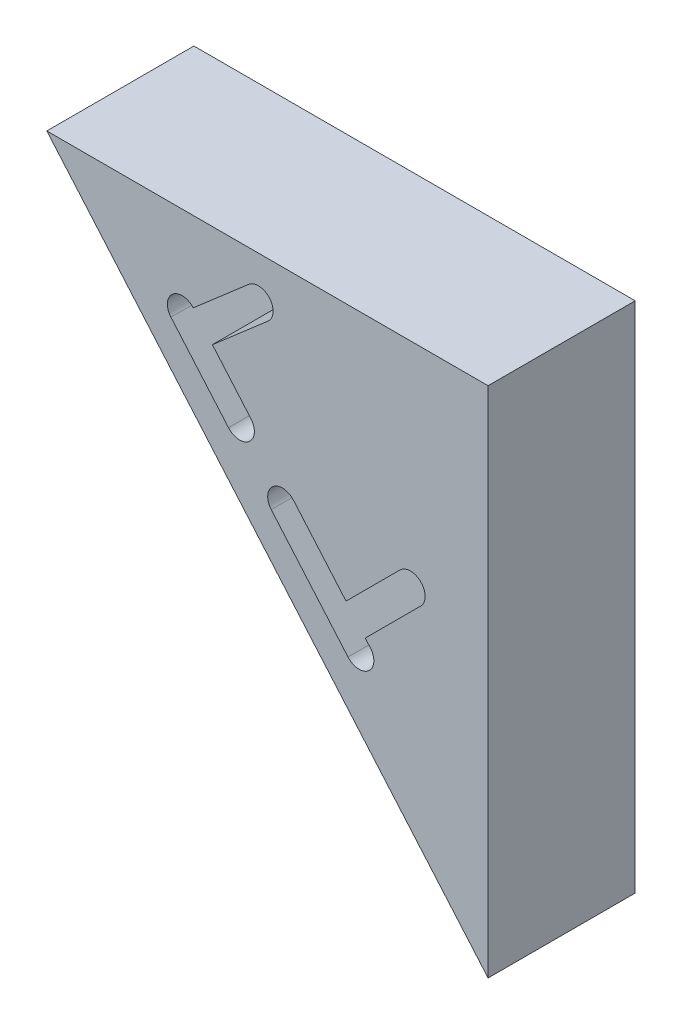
ISO-10303-21;
HEADER;
FILE_DESCRIPTION(('STEP AP214'),'2;1');
FILE_NAME('part.step','',(''),(''),'','','');
FILE_SCHEMA(('AUTOMOTIVE_DESIGN { 1 0 10303 214 1 1 1 1 }'));
ENDSEC;
DATA;
#1=APPLICATION_CONTEXT('core data for automotive mechanical design processes');
#2=APPLICATION_PROTOCOL_DEFINITION('international standard','automotive_design',2000,#1);
#3=PRODUCT_CONTEXT('',#1,'mechanical');
#4=PRODUCT('Part','Part','',(#3));
#5=PRODUCT_RELATED_PRODUCT_CATEGORY('part','',(#4));
#6=PRODUCT_DEFINITION_FORMATION('','',#4);
#7=PRODUCT_DEFINITION_CONTEXT('part definition',#1,'design');
#8=PRODUCT_DEFINITION('design','',#6,#7);
#9=PRODUCT_DEFINITION_SHAPE('','',#8);
#10=(LENGTH_UNIT() NAMED_UNIT(*) SI_UNIT(.MILLI.,.METRE.));
#11=(NAMED_UNIT(*) PLANE_ANGLE_UNIT() SI_UNIT($,.RADIAN.));
#12=(NAMED_UNIT(*) SI_UNIT($,.STERADIAN.) SOLID_ANGLE_UNIT());
#13=UNCERTAINTY_MEASURE_WITH_UNIT(LENGTH_MEASURE(1.E-05),#10,'distance_accuracy_value','');
#14=(GEOMETRIC_REPRESENTATION_CONTEXT(3) GLOBAL_UNCERTAINTY_ASSIGNED_CONTEXT((#13)) GLOBAL_UNIT_ASSIGNED_CONTEXT((#10,
#11,#12)) REPRESENTATION_CONTEXT('',''));
#15=CARTESIAN_POINT('',(0.,0.,0.));
#16=DIRECTION('',(0.,0.,1.));
#17=DIRECTION('',(1.,0.,0.));
#18=AXIS2_PLACEMENT_3D('',#15,#16,#17);
#19=CARTESIAN_POINT('',(-8.62003780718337,-7.4158961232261,5.));
#20=DIRECTION('',(0.758069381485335,0.652173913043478,0.));
#21=DIRECTION('',(-0.652173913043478,0.758069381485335,0.));
#22=AXIS2_PLACEMENT_3D('',#19,#20,#21);
#23=PLANE('',#22);
#24=DIRECTION('',(0.652173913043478,-0.758069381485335,0.));
#25=VECTOR('',#24,1.);
#26=CARTESIAN_POINT('',(-8.62003780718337,-7.4158961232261,0.));
#27=LINE('',#26,#25);
#28=CARTESIAN_POINT('',(-15.,0.,0.));
#29=VERTEX_POINT('',#28);
#30=CARTESIAN_POINT('',(0.,-17.4355957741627,0.));
#31=VERTEX_POINT('',#30);
#32=EDGE_CURVE('E189',#29,#31,#27,.T.);
#33=ORIENTED_EDGE('',*,*,#32,.T.);
#34=DIRECTION('',(0.,0.,-1.));
#35=VECTOR('',#34,1.);
#36=CARTESIAN_POINT('',(0.,-17.4355957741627,5.));
#37=LINE('',#36,#35);
#38=CARTESIAN_POINT('',(0.,-17.4355957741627,5.));
#39=VERTEX_POINT('',#38);
#40=EDGE_CURVE('E11',#39,#31,#37,.T.);
#41=ORIENTED_EDGE('',*,*,#40,.F.);
#42=DIRECTION('',(0.652173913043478,-0.758069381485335,0.));
#43=VECTOR('',#42,1.);
#44=CARTESIAN_POINT('',(-8.62003780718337,-7.4158961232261,5.));
#45=LINE('',#44,#43);
#46=CARTESIAN_POINT('',(-15.,0.,5.));
#47=VERTEX_POINT('',#46);
#48=EDGE_CURVE('E180',#47,#39,#45,.T.);
#49=ORIENTED_EDGE('',*,*,#48,.F.);
#50=DIRECTION('',(0.,0.,-1.));
#51=VECTOR('',#50,1.);
#52=CARTESIAN_POINT('',(-15.,0.,5.));
#53=LINE('',#52,#51);
#54=EDGE_CURVE('E190',#47,#29,#53,.T.);
#55=ORIENTED_EDGE('',*,*,#54,.T.);
#56=EDGE_LOOP('',(#33,#41,#49,#55));
#57=FACE_BOUND('',#56,.T.);
#58=ADVANCED_FACE('F41',(#57),#23,.F.);
#59=CARTESIAN_POINT('',(0.,0.,5.));
#60=DIRECTION('',(-1.,0.,0.));
#61=DIRECTION('',(0.,0.,1.));
#62=AXIS2_PLACEMENT_3D('',#59,#60,#61);
#63=PLANE('',#62);
#64=DIRECTION('',(0.,1.,0.));
#65=VECTOR('',#64,1.);
#66=CARTESIAN_POINT('',(0.,0.,0.));
#67=LINE('',#66,#65);
#68=CARTESIAN_POINT('',(0.,0.,0.));
#69=VERTEX_POINT('',#68);
#70=EDGE_CURVE('E118',#31,#69,#67,.T.);
#71=ORIENTED_EDGE('',*,*,#70,.T.);
#72=DIRECTION('',(0.,0.,-1.));
#73=VECTOR('',#72,1.);
#74=CARTESIAN_POINT('',(0.,0.,5.));
#75=LINE('',#74,#73);
#76=CARTESIAN_POINT('',(0.,0.,5.));
#77=VERTEX_POINT('',#76);
#78=EDGE_CURVE('E52',#77,#69,#75,.T.);
#79=ORIENTED_EDGE('',*,*,#78,.F.);
#80=DIRECTION('',(0.,1.,0.));
#81=VECTOR('',#80,1.);
#82=CARTESIAN_POINT('',(0.,0.,5.));
#83=LINE('',#82,#81);
#84=EDGE_CURVE('E175',#39,#77,#83,.T.);
#85=ORIENTED_EDGE('',*,*,#84,.F.);
#86=ORIENTED_EDGE('',*,*,#40,.T.);
#87=EDGE_LOOP('',(#71,#79,#85,#86));
#88=FACE_BOUND('',#87,.T.);
#89=ADVANCED_FACE('F176',(#88),#63,.F.);
#90=CARTESIAN_POINT('',(-6.99212655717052,-7.00813629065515,5.));
#91=DIRECTION('',(0.,0.,-1.));
#92=DIRECTION('',(-1.,0.,0.));
#93=AXIS2_PLACEMENT_3D('',#90,#91,#92);
#94=CYLINDRICAL_SURFACE('',#93,0.500000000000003);
#95=CARTESIAN_POINT('',(-6.99212655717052,-7.00813629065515,0.));
#96=DIRECTION('',(0.,0.,1.));
#97=DIRECTION('',(1.,0.,0.));
#98=AXIS2_PLACEMENT_3D('',#95,#96,#97);
#99=CIRCLE('',#98,0.500000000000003);
#100=CARTESIAN_POINT('',(-6.61309186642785,-6.68204933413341,0.));
#101=VERTEX_POINT('',#100);
#102=CARTESIAN_POINT('',(-7.37116124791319,-7.33422324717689,0.));
#103=VERTEX_POINT('',#102);
#104=EDGE_CURVE('E295',#101,#103,#99,.T.);
#105=ORIENTED_EDGE('',*,*,#104,.F.);
#106=DIRECTION('',(0.,0.,-1.));
#107=VECTOR('',#106,1.);
#108=CARTESIAN_POINT('',(-6.61309186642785,-6.68204933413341,5.));
#109=LINE('',#108,#107);
#110=CARTESIAN_POINT('',(-6.61309186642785,-6.68204933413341,5.));
#111=VERTEX_POINT('',#110);
#112=EDGE_CURVE('E208',#111,#101,#109,.T.);
#113=ORIENTED_EDGE('',*,*,#112,.F.);
#114=CARTESIAN_POINT('',(-6.99212655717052,-7.00813629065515,5.));
#115=DIRECTION('',(0.,0.,1.));
#116=DIRECTION('',(1.,0.,0.));
#117=AXIS2_PLACEMENT_3D('',#114,#115,#116);
#118=CIRCLE('',#117,0.500000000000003);
#119=CARTESIAN_POINT('',(-7.37116124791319,-7.33422324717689,5.));
#120=VERTEX_POINT('',#119);
#121=EDGE_CURVE('E378',#111,#120,#118,.T.);
#122=ORIENTED_EDGE('',*,*,#121,.T.);
#123=DIRECTION('',(0.,0.,-1.));
#124=VECTOR('',#123,1.);
#125=CARTESIAN_POINT('',(-7.37116124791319,-7.33422324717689,5.));
#126=LINE('',#125,#124);
#127=EDGE_CURVE('E211',#120,#103,#126,.T.);
#128=ORIENTED_EDGE('',*,*,#127,.T.);
#129=EDGE_LOOP('',(#105,#113,#122,#128));
#130=FACE_BOUND('',#129,.T.);
#131=ADVANCED_FACE('F352',(#130),#94,.F.);
#132=CARTESIAN_POINT('',(-7.1038990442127,-6.11154829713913,5.));
#133=DIRECTION('',(-0.758069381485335,-0.652173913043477,0.));
#134=DIRECTION('',(0.652173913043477,-0.758069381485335,0.));
#135=AXIS2_PLACEMENT_3D('',#132,#133,#134);
#136=PLANE('',#135);
#137=DIRECTION('',(-0.652173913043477,0.758069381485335,0.));
#138=VECTOR('',#137,1.);
#139=CARTESIAN_POINT('',(-7.1038990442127,-6.11154829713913,0.));
#140=LINE('',#139,#138);
#141=CARTESIAN_POINT('',(-4.82917280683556,-8.75562877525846,0.));
#142=VERTEX_POINT('',#141);
#143=EDGE_CURVE('E299',#142,#101,#140,.T.);
#144=ORIENTED_EDGE('',*,*,#143,.F.);
#145=DIRECTION('',(0.,0.,-1.));
#146=VECTOR('',#145,1.);
#147=CARTESIAN_POINT('',(-4.82917280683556,-8.75562877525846,5.));
#148=LINE('',#147,#146);
#149=CARTESIAN_POINT('',(-4.82917280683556,-8.75562877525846,5.));
#150=VERTEX_POINT('',#149);
#151=EDGE_CURVE('E229',#150,#142,#148,.T.);
#152=ORIENTED_EDGE('',*,*,#151,.F.);
#153=DIRECTION('',(-0.652173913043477,0.758069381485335,0.));
#154=VECTOR('',#153,1.);
#155=CARTESIAN_POINT('',(-7.1038990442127,-6.11154829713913,5.));
#156=LINE('',#155,#154);
#157=EDGE_CURVE('E348',#150,#111,#156,.T.);
#158=ORIENTED_EDGE('',*,*,#157,.T.);
#159=ORIENTED_EDGE('',*,*,#112,.T.);
#160=EDGE_LOOP('',(#144,#152,#158,#159));
#161=FACE_BOUND('',#160,.T.);
#162=ADVANCED_FACE('F343',(#161),#136,.T.);
#163=CARTESIAN_POINT('',(1.96322798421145,-1.96322798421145,5.));
#164=DIRECTION('',(-0.707106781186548,0.707106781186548,0.));
#165=DIRECTION('',(-0.707106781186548,-0.707106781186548,0.));
#166=AXIS2_PLACEMENT_3D('',#163,#164,#165);
#167=PLANE('',#166);
#168=DIRECTION('',(0.707106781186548,0.707106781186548,0.));
#169=VECTOR('',#168,1.);
#170=CARTESIAN_POINT('',(1.96322798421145,-1.96322798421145,0.));
#171=LINE('',#170,#169);
#172=CARTESIAN_POINT('',(-2.99394781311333,-6.92040378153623,0.));
#173=VERTEX_POINT('',#172);
#174=EDGE_CURVE('E303',#142,#173,#171,.T.);
#175=ORIENTED_EDGE('',*,*,#174,.T.);
#176=DIRECTION('',(0.,0.,-1.));
#177=VECTOR('',#176,1.);
#178=CARTESIAN_POINT('',(-2.99394781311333,-6.92040378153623,5.));
#179=LINE('',#178,#177);
#180=CARTESIAN_POINT('',(-2.99394781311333,-6.92040378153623,5.));
#181=VERTEX_POINT('',#180);
#182=EDGE_CURVE('E226',#181,#173,#179,.T.);
#183=ORIENTED_EDGE('',*,*,#182,.F.);
#184=DIRECTION('',(0.707106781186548,0.707106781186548,0.));
#185=VECTOR('',#184,1.);
#186=CARTESIAN_POINT('',(1.96322798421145,-1.96322798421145,5.));
#187=LINE('',#186,#185);
#188=EDGE_CURVE('E374',#150,#181,#187,.T.);
#189=ORIENTED_EDGE('',*,*,#188,.F.);
#190=ORIENTED_EDGE('',*,*,#151,.T.);
#191=EDGE_LOOP('',(#175,#183,#189,#190));
#192=FACE_BOUND('',#191,.T.);
#193=ADVANCED_FACE('F446',(#192),#167,.F.);
#194=CARTESIAN_POINT('',(-2.64039442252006,-7.27395717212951,5.));
#195=DIRECTION('',(0.,0.,-1.));
#196=DIRECTION('',(-1.,0.,0.));
#197=AXIS2_PLACEMENT_3D('',#194,#195,#196);
#198=CYLINDRICAL_SURFACE('',#197,0.5);
#199=CARTESIAN_POINT('',(-2.64039442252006,-7.27395717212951,0.));
#200=DIRECTION('',(0.,0.,1.));
#201=DIRECTION('',(1.,0.,0.));
#202=AXIS2_PLACEMENT_3D('',#199,#200,#201);
#203=CIRCLE('',#202,0.5);
#204=CARTESIAN_POINT('',(-2.28684103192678,-7.62751056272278,0.));
#205=VERTEX_POINT('',#204);
#206=EDGE_CURVE('E308',#205,#173,#203,.T.);
#207=ORIENTED_EDGE('',*,*,#206,.F.);
#208=DIRECTION('',(0.,0.,-1.));
#209=VECTOR('',#208,1.);
#210=CARTESIAN_POINT('',(-2.28684103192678,-7.62751056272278,5.));
#211=LINE('',#210,#209);
#212=CARTESIAN_POINT('',(-2.28684103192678,-7.62751056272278,5.));
#213=VERTEX_POINT('',#212);
#214=EDGE_CURVE('E223',#213,#205,#211,.T.);
#215=ORIENTED_EDGE('',*,*,#214,.F.);
#216=CARTESIAN_POINT('',(-2.64039442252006,-7.27395717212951,5.));
#217=DIRECTION('',(0.,0.,1.));
#218=DIRECTION('',(1.,0.,0.));
#219=AXIS2_PLACEMENT_3D('',#216,#217,#218);
#220=CIRCLE('',#219,0.5);
#221=EDGE_CURVE('E371',#213,#181,#220,.T.);
#222=ORIENTED_EDGE('',*,*,#221,.T.);
#223=ORIENTED_EDGE('',*,*,#182,.T.);
#224=EDGE_LOOP('',(#207,#215,#222,#223));
#225=FACE_BOUND('',#224,.T.);
#226=ADVANCED_FACE('F337',(#225),#198,.F.);
#227=CARTESIAN_POINT('',(2.670334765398,-2.670334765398,5.));
#228=DIRECTION('',(-0.707106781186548,0.707106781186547,0.));
#229=DIRECTION('',(-0.707106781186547,-0.707106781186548,0.));
#230=AXIS2_PLACEMENT_3D('',#227,#228,#229);
#231=PLANE('',#230);
#232=DIRECTION('',(0.707106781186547,0.707106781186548,0.));
#233=VECTOR('',#232,1.);
#234=CARTESIAN_POINT('',(2.670334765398,-2.670334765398,0.));
#235=LINE('',#234,#233);
#236=CARTESIAN_POINT('',(-4.17516282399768,-9.51583235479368,0.));
#237=VERTEX_POINT('',#236);
#238=EDGE_CURVE('E312',#237,#205,#235,.T.);
#239=ORIENTED_EDGE('',*,*,#238,.F.);
#240=DIRECTION('',(0.,0.,-1.));
#241=VECTOR('',#240,1.);
#242=CARTESIAN_POINT('',(-4.17516282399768,-9.51583235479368,5.));
#243=LINE('',#242,#241);
#244=CARTESIAN_POINT('',(-4.17516282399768,-9.51583235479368,5.));
#245=VERTEX_POINT('',#244);
#246=EDGE_CURVE('E220',#245,#237,#243,.T.);
#247=ORIENTED_EDGE('',*,*,#246,.F.);
#248=DIRECTION('',(0.707106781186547,0.707106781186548,0.));
#249=VECTOR('',#248,1.);
#250=CARTESIAN_POINT('',(2.670334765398,-2.670334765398,5.));
#251=LINE('',#250,#249);
#252=EDGE_CURVE('E333',#245,#213,#251,.T.);
#253=ORIENTED_EDGE('',*,*,#252,.T.);
#254=ORIENTED_EDGE('',*,*,#214,.T.);
#255=EDGE_LOOP('',(#239,#247,#253,#254));
#256=FACE_BOUND('',#255,.T.);
#257=ADVANCED_FACE('F331',(#256),#231,.T.);
#258=CARTESIAN_POINT('',(-4.00439621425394,-9.71432686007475,0.));
#259=VERTEX_POINT('',#258);
#260=EDGE_CURVE('E304',#259,#237,#140,.T.);
#261=ORIENTED_EDGE('',*,*,#260,.F.);
#262=DIRECTION('',(0.,0.,-1.));
#263=VECTOR('',#262,1.);
#264=CARTESIAN_POINT('',(-4.00439621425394,-9.71432686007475,5.));
#265=LINE('',#264,#263);
#266=CARTESIAN_POINT('',(-4.00439621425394,-9.71432686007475,5.));
#267=VERTEX_POINT('',#266);
#268=EDGE_CURVE('E217',#267,#259,#265,.T.);
#269=ORIENTED_EDGE('',*,*,#268,.F.);
#270=EDGE_CURVE('E327',#267,#245,#156,.T.);
#271=ORIENTED_EDGE('',*,*,#270,.T.);
#272=ORIENTED_EDGE('',*,*,#246,.T.);
#273=EDGE_LOOP('',(#261,#269,#271,#272));
#274=FACE_BOUND('',#273,.T.);
#275=ADVANCED_FACE('F324',(#274),#136,.T.);
#276=CARTESIAN_POINT('',(-4.38343090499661,-10.0404138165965,5.));
#277=DIRECTION('',(0.,0.,-1.));
#278=DIRECTION('',(-1.,0.,0.));
#279=AXIS2_PLACEMENT_3D('',#276,#277,#278);
#280=CYLINDRICAL_SURFACE('',#279,0.500000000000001);
#281=CARTESIAN_POINT('',(-4.38343090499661,-10.0404138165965,0.));
#282=DIRECTION('',(0.,0.,1.));
#283=DIRECTION('',(1.,0.,0.));
#284=AXIS2_PLACEMENT_3D('',#281,#282,#283);
#285=CIRCLE('',#284,0.500000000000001);
#286=CARTESIAN_POINT('',(-4.76246559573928,-10.3665007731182,0.));
#287=VERTEX_POINT('',#286);
#288=EDGE_CURVE('E199',#287,#259,#285,.T.);
#289=ORIENTED_EDGE('',*,*,#288,.F.);
#290=DIRECTION('',(0.,0.,-1.));
#291=VECTOR('',#290,1.);
#292=CARTESIAN_POINT('',(-4.76246559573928,-10.3665007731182,5.));
#293=LINE('',#292,#291);
#294=CARTESIAN_POINT('',(-4.76246559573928,-10.3665007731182,5.));
#295=VERTEX_POINT('',#294);
#296=EDGE_CURVE('E214',#295,#287,#293,.T.);
#297=ORIENTED_EDGE('',*,*,#296,.F.);
#298=CARTESIAN_POINT('',(-4.38343090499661,-10.0404138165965,5.));
#299=DIRECTION('',(0.,0.,1.));
#300=DIRECTION('',(1.,0.,0.));
#301=AXIS2_PLACEMENT_3D('',#298,#299,#300);
#302=CIRCLE('',#301,0.500000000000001);
#303=EDGE_CURVE('E360',#295,#267,#302,.T.);
#304=ORIENTED_EDGE('',*,*,#303,.T.);
#305=ORIENTED_EDGE('',*,*,#268,.T.);
#306=EDGE_LOOP('',(#289,#297,#304,#305));
#307=FACE_BOUND('',#306,.T.);
#308=ADVANCED_FACE('F356',(#307),#280,.F.);
#309=CARTESIAN_POINT('',(-10.401665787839,-3.04796003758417,5.));
#310=DIRECTION('',(0.,0.,-1.));
#311=DIRECTION('',(-1.,0.,0.));
#312=AXIS2_PLACEMENT_3D('',#309,#310,#311);
#313=CYLINDRICAL_SURFACE('',#312,0.500000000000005);
#314=CARTESIAN_POINT('',(-10.401665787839,-3.04796003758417,0.));
#315=DIRECTION('',(0.,0.,1.));
#316=DIRECTION('',(1.,0.,0.));
#317=AXIS2_PLACEMENT_3D('',#314,#315,#316);
#318=CIRCLE('',#317,0.500000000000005);
#319=CARTESIAN_POINT('',(-10.0239015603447,-2.72040212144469,0.));
#320=VERTEX_POINT('',#319);
#321=CARTESIAN_POINT('',(-10.7807004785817,-3.37404699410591,0.));
#322=VERTEX_POINT('',#321);
#323=EDGE_CURVE('E268',#320,#322,#318,.T.);
#324=ORIENTED_EDGE('',*,*,#323,.F.);
#325=DIRECTION('',(0.,0.,-1.));
#326=VECTOR('',#325,1.);
#327=CARTESIAN_POINT('',(-10.0239015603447,-2.72040212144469,5.));
#328=LINE('',#327,#326);
#329=CARTESIAN_POINT('',(-10.0239015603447,-2.72040212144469,5.));
#330=VERTEX_POINT('',#329);
#331=EDGE_CURVE('E45',#330,#320,#328,.T.);
#332=ORIENTED_EDGE('',*,*,#331,.F.);
#333=CARTESIAN_POINT('',(-10.401665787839,-3.04796003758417,5.));
#334=DIRECTION('',(0.,0.,1.));
#335=DIRECTION('',(1.,0.,0.));
#336=AXIS2_PLACEMENT_3D('',#333,#334,#335);
#337=CIRCLE('',#336,0.500000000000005);
#338=CARTESIAN_POINT('',(-10.7807004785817,-3.37404699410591,5.));
#339=VERTEX_POINT('',#338);
#340=EDGE_CURVE('E205',#330,#339,#337,.T.);
#341=ORIENTED_EDGE('',*,*,#340,.T.);
#342=DIRECTION('',(0.,0.,-1.));
#343=VECTOR('',#342,1.);
#344=CARTESIAN_POINT('',(-10.7807004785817,-3.37404699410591,5.));
#345=LINE('',#344,#343);
#346=EDGE_CURVE('E234',#339,#322,#345,.T.);
#347=ORIENTED_EDGE('',*,*,#346,.T.);
#348=EDGE_LOOP('',(#324,#332,#341,#347));
#349=FACE_BOUND('',#348,.T.);
#350=ADVANCED_FACE('F43',(#349),#313,.F.);
#351=CARTESIAN_POINT('',(-2.9555389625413,3.40854803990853,5.));
#352=DIRECTION('',(-0.655115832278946,0.755528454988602,0.));
#353=DIRECTION('',(-0.755528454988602,-0.655115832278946,0.));
#354=AXIS2_PLACEMENT_3D('',#351,#352,#353);
#355=PLANE('',#354);
#356=DIRECTION('',(0.755528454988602,0.655115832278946,0.));
#357=VECTOR('',#356,1.);
#358=CARTESIAN_POINT('',(-2.9555389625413,3.40854803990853,0.));
#359=LINE('',#358,#357);
#360=CARTESIAN_POINT('',(-8.13623488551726,-1.08361357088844,0.));
#361=VERTEX_POINT('',#360);
#362=EDGE_CURVE('E259',#320,#361,#359,.T.);
#363=ORIENTED_EDGE('',*,*,#362,.T.);
#364=DIRECTION('',(0.,0.,-1.));
#365=VECTOR('',#364,1.);
#366=CARTESIAN_POINT('',(-8.13623488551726,-1.08361357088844,5.));
#367=LINE('',#366,#365);
#368=CARTESIAN_POINT('',(-8.13623488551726,-1.08361357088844,5.));
#369=VERTEX_POINT('',#368);
#370=EDGE_CURVE('E248',#369,#361,#367,.T.);
#371=ORIENTED_EDGE('',*,*,#370,.F.);
#372=DIRECTION('',(0.755528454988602,0.655115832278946,0.));
#373=VECTOR('',#372,1.);
#374=CARTESIAN_POINT('',(-2.9555389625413,3.40854803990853,5.));
#375=LINE('',#374,#373);
#376=EDGE_CURVE('E261',#330,#369,#375,.T.);
#377=ORIENTED_EDGE('',*,*,#376,.F.);
#378=ORIENTED_EDGE('',*,*,#331,.T.);
#379=EDGE_LOOP('',(#363,#371,#377,#378));
#380=FACE_BOUND('',#379,.T.);
#381=ADVANCED_FACE('F258',(#380),#355,.F.);
#382=CARTESIAN_POINT('',(-7.80867696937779,-1.46137779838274,5.));
#383=DIRECTION('',(0.,0.,-1.));
#384=DIRECTION('',(-1.,0.,0.));
#385=AXIS2_PLACEMENT_3D('',#382,#383,#384);
#386=CYLINDRICAL_SURFACE('',#385,0.500000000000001);
#387=CARTESIAN_POINT('',(-7.80867696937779,-1.46137779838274,0.));
#388=DIRECTION('',(0.,0.,1.));
#389=DIRECTION('',(1.,0.,0.));
#390=AXIS2_PLACEMENT_3D('',#387,#388,#389);
#391=CIRCLE('',#390,0.500000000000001);
#392=CARTESIAN_POINT('',(-7.48111905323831,-1.83914202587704,0.));
#393=VERTEX_POINT('',#392);
#394=EDGE_CURVE('E270',#393,#361,#391,.T.);
#395=ORIENTED_EDGE('',*,*,#394,.F.);
#396=DIRECTION('',(0.,0.,-1.));
#397=VECTOR('',#396,1.);
#398=CARTESIAN_POINT('',(-7.48111905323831,-1.83914202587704,5.));
#399=LINE('',#398,#397);
#400=CARTESIAN_POINT('',(-7.48111905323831,-1.83914202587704,5.));
#401=VERTEX_POINT('',#400);
#402=EDGE_CURVE('E246',#401,#393,#399,.T.);
#403=ORIENTED_EDGE('',*,*,#402,.F.);
#404=CARTESIAN_POINT('',(-7.80867696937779,-1.46137779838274,5.));
#405=DIRECTION('',(0.,0.,1.));
#406=DIRECTION('',(1.,0.,0.));
#407=AXIS2_PLACEMENT_3D('',#404,#405,#406);
#408=CIRCLE('',#407,0.500000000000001);
#409=EDGE_CURVE('E396',#401,#369,#408,.T.);
#410=ORIENTED_EDGE('',*,*,#409,.T.);
#411=ORIENTED_EDGE('',*,*,#370,.T.);
#412=EDGE_LOOP('',(#395,#403,#410,#411));
#413=FACE_BOUND('',#412,.T.);
#414=ADVANCED_FACE('F419',(#413),#386,.F.);
#415=CARTESIAN_POINT('',(-2.30042313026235,2.65301958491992,5.));
#416=DIRECTION('',(-0.655115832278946,0.755528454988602,0.));
#417=DIRECTION('',(-0.755528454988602,-0.655115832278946,0.));
#418=AXIS2_PLACEMENT_3D('',#415,#416,#417);
#419=PLANE('',#418);
#420=DIRECTION('',(0.755528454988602,0.655115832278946,0.));
#421=VECTOR('',#420,1.);
#422=CARTESIAN_POINT('',(-2.30042313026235,2.65301958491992,0.));
#423=LINE('',#422,#421);
#424=CARTESIAN_POINT('',(-9.37171986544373,-3.47847475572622,0.));
#425=VERTEX_POINT('',#424);
#426=EDGE_CURVE('E281',#425,#393,#423,.T.);
#427=ORIENTED_EDGE('',*,*,#426,.F.);
#428=DIRECTION('',(0.,0.,-1.));
#429=VECTOR('',#428,1.);
#430=CARTESIAN_POINT('',(-9.37171986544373,-3.47847475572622,5.));
#431=LINE('',#430,#429);
#432=CARTESIAN_POINT('',(-9.37171986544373,-3.47847475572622,5.));
#433=VERTEX_POINT('',#432);
#434=EDGE_CURVE('E243',#433,#425,#431,.T.);
#435=ORIENTED_EDGE('',*,*,#434,.F.);
#436=DIRECTION('',(0.755528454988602,0.655115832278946,0.));
#437=VECTOR('',#436,1.);
#438=CARTESIAN_POINT('',(-2.30042313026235,2.65301958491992,5.));
#439=LINE('',#438,#437);
#440=EDGE_CURVE('E392',#433,#401,#439,.T.);
#441=ORIENTED_EDGE('',*,*,#440,.T.);
#442=ORIENTED_EDGE('',*,*,#402,.T.);
#443=EDGE_LOOP('',(#427,#435,#441,#442));
#444=FACE_BOUND('',#443,.T.);
#445=ADVANCED_FACE('F417',(#444),#419,.T.);
#446=CARTESIAN_POINT('',(-7.10537246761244,-6.1128158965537,5.));
#447=DIRECTION('',(-0.758069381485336,-0.652173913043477,0.));
#448=DIRECTION('',(0.652173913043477,-0.758069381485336,0.));
#449=AXIS2_PLACEMENT_3D('',#446,#447,#448);
#450=PLANE('',#449);
#451=DIRECTION('',(-0.652173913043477,0.758069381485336,0.));
#452=VECTOR('',#451,1.);
#453=CARTESIAN_POINT('',(-7.10537246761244,-6.1128158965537,0.));
#454=LINE('',#453,#452);
#455=CARTESIAN_POINT('',(-8.06610935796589,-4.99608122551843,0.));
#456=VERTEX_POINT('',#455);
#457=EDGE_CURVE('E284',#456,#425,#454,.T.);
#458=ORIENTED_EDGE('',*,*,#457,.F.);
#459=DIRECTION('',(0.,0.,-1.));
#460=VECTOR('',#459,1.);
#461=CARTESIAN_POINT('',(-8.06610935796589,-4.99608122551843,5.));
#462=LINE('',#461,#460);
#463=CARTESIAN_POINT('',(-8.06610935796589,-4.99608122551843,5.));
#464=VERTEX_POINT('',#463);
#465=EDGE_CURVE('E240',#464,#456,#462,.T.);
#466=ORIENTED_EDGE('',*,*,#465,.F.);
#467=DIRECTION('',(-0.652173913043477,0.758069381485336,0.));
#468=VECTOR('',#467,1.);
#469=CARTESIAN_POINT('',(-7.10537246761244,-6.1128158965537,5.));
#470=LINE('',#469,#468);
#471=EDGE_CURVE('E388',#464,#433,#470,.T.);
#472=ORIENTED_EDGE('',*,*,#471,.T.);
#473=ORIENTED_EDGE('',*,*,#434,.T.);
#474=EDGE_LOOP('',(#458,#466,#472,#473));
#475=FACE_BOUND('',#474,.T.);
#476=ADVANCED_FACE('F414',(#475),#450,.T.);
#477=CARTESIAN_POINT('',(-8.44514404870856,-5.32216818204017,5.));
#478=DIRECTION('',(0.,0.,-1.));
#479=DIRECTION('',(-1.,0.,0.));
#480=AXIS2_PLACEMENT_3D('',#477,#478,#479);
#481=CYLINDRICAL_SURFACE('',#480,0.500000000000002);
#482=CARTESIAN_POINT('',(-8.44514404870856,-5.32216818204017,0.));
#483=DIRECTION('',(0.,0.,1.));
#484=DIRECTION('',(1.,0.,0.));
#485=AXIS2_PLACEMENT_3D('',#482,#483,#484);
#486=CIRCLE('',#485,0.500000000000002);
#487=CARTESIAN_POINT('',(-8.82417873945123,-5.64825513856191,0.));
#488=VERTEX_POINT('',#487);
#489=EDGE_CURVE('E288',#488,#456,#486,.T.);
#490=ORIENTED_EDGE('',*,*,#489,.F.);
#491=DIRECTION('',(0.,0.,-1.));
#492=VECTOR('',#491,1.);
#493=CARTESIAN_POINT('',(-8.82417873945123,-5.64825513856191,5.));
#494=LINE('',#493,#492);
#495=CARTESIAN_POINT('',(-8.82417873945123,-5.64825513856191,5.));
#496=VERTEX_POINT('',#495);
#497=EDGE_CURVE('E237',#496,#488,#494,.T.);
#498=ORIENTED_EDGE('',*,*,#497,.F.);
#499=CARTESIAN_POINT('',(-8.44514404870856,-5.32216818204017,5.));
#500=DIRECTION('',(0.,0.,1.));
#501=DIRECTION('',(1.,0.,0.));
#502=AXIS2_PLACEMENT_3D('',#499,#500,#501);
#503=CIRCLE('',#502,0.500000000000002);
#504=EDGE_CURVE('E384',#496,#464,#503,.T.);
#505=ORIENTED_EDGE('',*,*,#504,.T.);
#506=ORIENTED_EDGE('',*,*,#465,.T.);
#507=EDGE_LOOP('',(#490,#498,#505,#506));
#508=FACE_BOUND('',#507,.T.);
#509=ADVANCED_FACE('F411',(#508),#481,.F.);
#510=CARTESIAN_POINT('',(-7.86196842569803,-6.76372221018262,5.));
#511=DIRECTION('',(-0.758069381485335,-0.652173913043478,0.));
#512=DIRECTION('',(0.652173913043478,-0.758069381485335,0.));
#513=AXIS2_PLACEMENT_3D('',#510,#511,#512);
#514=PLANE('',#513);
#515=DIRECTION('',(-0.652173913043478,0.758069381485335,0.));
#516=VECTOR('',#515,1.);
#517=CARTESIAN_POINT('',(-7.86196842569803,-6.76372221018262,0.));
#518=LINE('',#517,#516);
#519=EDGE_CURVE('E193',#287,#103,#518,.T.);
#520=ORIENTED_EDGE('',*,*,#519,.T.);
#521=ORIENTED_EDGE('',*,*,#127,.F.);
#522=DIRECTION('',(-0.652173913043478,0.758069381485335,0.));
#523=VECTOR('',#522,1.);
#524=CARTESIAN_POINT('',(-7.86196842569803,-6.76372221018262,5.));
#525=LINE('',#524,#523);
#526=EDGE_CURVE('E186',#295,#120,#525,.T.);
#527=ORIENTED_EDGE('',*,*,#526,.F.);
#528=ORIENTED_EDGE('',*,*,#296,.T.);
#529=EDGE_LOOP('',(#520,#521,#527,#528));
#530=FACE_BOUND('',#529,.T.);
#531=ADVANCED_FACE('F435',(#530),#514,.F.);
#532=CARTESIAN_POINT('',(-7.86344184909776,-6.76498980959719,5.));
#533=DIRECTION('',(-0.758069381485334,-0.652173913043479,0.));
#534=DIRECTION('',(0.652173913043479,-0.758069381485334,0.));
#535=AXIS2_PLACEMENT_3D('',#532,#533,#534);
#536=PLANE('',#535);
#537=DIRECTION('',(-0.652173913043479,0.758069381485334,0.));
#538=VECTOR('',#537,1.);
#539=CARTESIAN_POINT('',(-7.86344184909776,-6.76498980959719,0.));
#540=LINE('',#539,#538);
#541=EDGE_CURVE('E292',#488,#322,#540,.T.);
#542=ORIENTED_EDGE('',*,*,#541,.T.);
#543=ORIENTED_EDGE('',*,*,#346,.F.);
#544=DIRECTION('',(-0.652173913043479,0.758069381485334,0.));
#545=VECTOR('',#544,1.);
#546=CARTESIAN_POINT('',(-7.86344184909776,-6.76498980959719,5.));
#547=LINE('',#546,#545);
#548=EDGE_CURVE('E381',#496,#339,#547,.T.);
#549=ORIENTED_EDGE('',*,*,#548,.F.);
#550=ORIENTED_EDGE('',*,*,#497,.T.);
#551=EDGE_LOOP('',(#542,#543,#549,#550));
#552=FACE_BOUND('',#551,.T.);
#553=ADVANCED_FACE('F408',(#552),#536,.F.);
#554=CARTESIAN_POINT('',(0.,0.,5.));
#555=DIRECTION('',(0.,-1.,0.));
#556=DIRECTION('',(1.,0.,0.));
#557=AXIS2_PLACEMENT_3D('',#554,#555,#556);
#558=PLANE('',#557);
#559=DIRECTION('',(-1.,0.,0.));
#560=VECTOR('',#559,1.);
#561=CARTESIAN_POINT('',(0.,0.,0.));
#562=LINE('',#561,#560);
#563=EDGE_CURVE('E124',#69,#29,#562,.T.);
#564=ORIENTED_EDGE('',*,*,#563,.T.);
#565=ORIENTED_EDGE('',*,*,#54,.F.);
#566=DIRECTION('',(-1.,0.,0.));
#567=VECTOR('',#566,1.);
#568=CARTESIAN_POINT('',(0.,0.,5.));
#569=LINE('',#568,#567);
#570=EDGE_CURVE('E61',#77,#47,#569,.T.);
#571=ORIENTED_EDGE('',*,*,#570,.F.);
#572=ORIENTED_EDGE('',*,*,#78,.T.);
#573=EDGE_LOOP('',(#564,#565,#571,#572));
#574=FACE_BOUND('',#573,.T.);
#575=ADVANCED_FACE('F453',(#574),#558,.F.);
#576=CARTESIAN_POINT('',(0.,0.,5.));
#577=DIRECTION('',(0.,0.,1.));
#578=DIRECTION('',(1.,0.,0.));
#579=AXIS2_PLACEMENT_3D('',#576,#577,#578);
#580=PLANE('',#579);
#581=ORIENTED_EDGE('',*,*,#340,.F.);
#582=ORIENTED_EDGE('',*,*,#376,.T.);
#583=ORIENTED_EDGE('',*,*,#409,.F.);
#584=ORIENTED_EDGE('',*,*,#440,.F.);
#585=ORIENTED_EDGE('',*,*,#471,.F.);
#586=ORIENTED_EDGE('',*,*,#504,.F.);
#587=ORIENTED_EDGE('',*,*,#548,.T.);
#588=EDGE_LOOP('',(#581,#582,#583,#584,#585,#586,#587));
#589=FACE_BOUND('',#588,.T.);
#590=ORIENTED_EDGE('',*,*,#121,.F.);
#591=ORIENTED_EDGE('',*,*,#157,.F.);
#592=ORIENTED_EDGE('',*,*,#188,.T.);
#593=ORIENTED_EDGE('',*,*,#221,.F.);
#594=ORIENTED_EDGE('',*,*,#252,.F.);
#595=ORIENTED_EDGE('',*,*,#270,.F.);
#596=ORIENTED_EDGE('',*,*,#303,.F.);
#597=ORIENTED_EDGE('',*,*,#526,.T.);
#598=EDGE_LOOP('',(#590,#591,#592,#593,#594,#595,#596,#597));
#599=FACE_BOUND('',#598,.T.);
#600=ORIENTED_EDGE('',*,*,#48,.T.);
#601=ORIENTED_EDGE('',*,*,#84,.T.);
#602=ORIENTED_EDGE('',*,*,#570,.T.);
#603=EDGE_LOOP('',(#600,#601,#602));
#604=FACE_BOUND('',#603,.T.);
#605=ADVANCED_FACE('F183',(#589,#599,#604),#580,.T.);
#606=CARTESIAN_POINT('',(0.,0.,0.));
#607=DIRECTION('',(0.,0.,1.));
#608=DIRECTION('',(1.,0.,0.));
#609=AXIS2_PLACEMENT_3D('',#606,#607,#608);
#610=PLANE('',#609);
#611=ORIENTED_EDGE('',*,*,#323,.T.);
#612=ORIENTED_EDGE('',*,*,#541,.F.);
#613=ORIENTED_EDGE('',*,*,#489,.T.);
#614=ORIENTED_EDGE('',*,*,#457,.T.);
#615=ORIENTED_EDGE('',*,*,#426,.T.);
#616=ORIENTED_EDGE('',*,*,#394,.T.);
#617=ORIENTED_EDGE('',*,*,#362,.F.);
#618=EDGE_LOOP('',(#611,#612,#613,#614,#615,#616,#617));
#619=FACE_BOUND('',#618,.T.);
#620=ORIENTED_EDGE('',*,*,#104,.T.);
#621=ORIENTED_EDGE('',*,*,#519,.F.);
#622=ORIENTED_EDGE('',*,*,#288,.T.);
#623=ORIENTED_EDGE('',*,*,#260,.T.);
#624=ORIENTED_EDGE('',*,*,#238,.T.);
#625=ORIENTED_EDGE('',*,*,#206,.T.);
#626=ORIENTED_EDGE('',*,*,#174,.F.);
#627=ORIENTED_EDGE('',*,*,#143,.T.);
#628=EDGE_LOOP('',(#620,#621,#622,#623,#624,#625,#626,#627));
#629=FACE_BOUND('',#628,.T.);
#630=ORIENTED_EDGE('',*,*,#32,.F.);
#631=ORIENTED_EDGE('',*,*,#563,.F.);
#632=ORIENTED_EDGE('',*,*,#70,.F.);
#633=EDGE_LOOP('',(#630,#631,#632));
#634=FACE_BOUND('',#633,.T.);
#635=ADVANCED_FACE('F265',(#619,#629,#634),#610,.F.);
#636=CLOSED_SHELL('',(#58,#89,#131,#162,#193,#226,#257,#275,#308,#350,#381,#414,#445,#476,#509,
#531,#553,#575,#605,#635));
#637=MANIFOLD_SOLID_BREP('B2',#636);
#638=ADVANCED_BREP_SHAPE_REPRESENTATION('',(#18,#637),#14);
#639=SHAPE_DEFINITION_REPRESENTATION(#9,#638);
ENDSEC;
END-ISO-10303-21;
